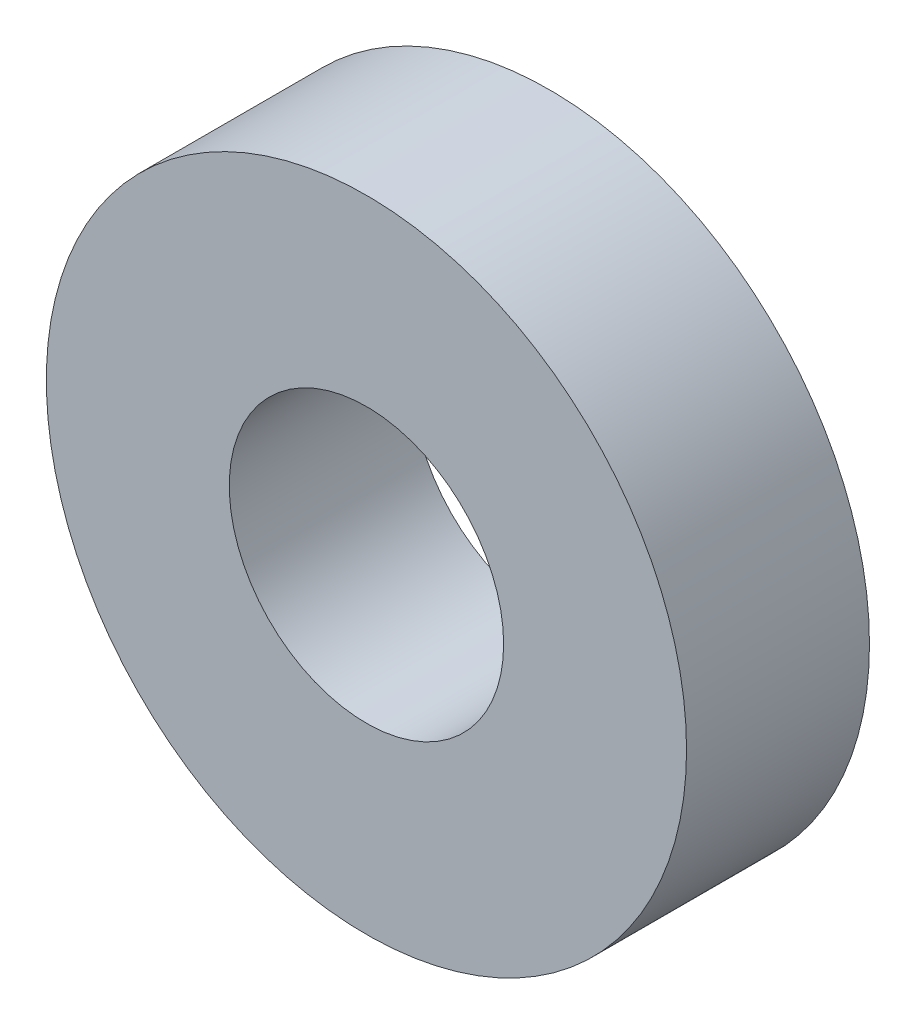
from build123d import *

# Parameters (mm, degrees)
SKETCH1_R           = 1.75
SKETCH1_R_2         = 0.75
BOSS_EXTRUDE1_DEPTH = 1


with BuildPart() as part:
    # Sketch1 → Boss-Extrude1 (new body)
    with BuildSketch(Plane.XY):
        Circle(SKETCH1_R)
        Circle(SKETCH1_R_2, mode=Mode.SUBTRACT)
    extrude(amount=BOSS_EXTRUDE1_DEPTH)


solid = part.part
